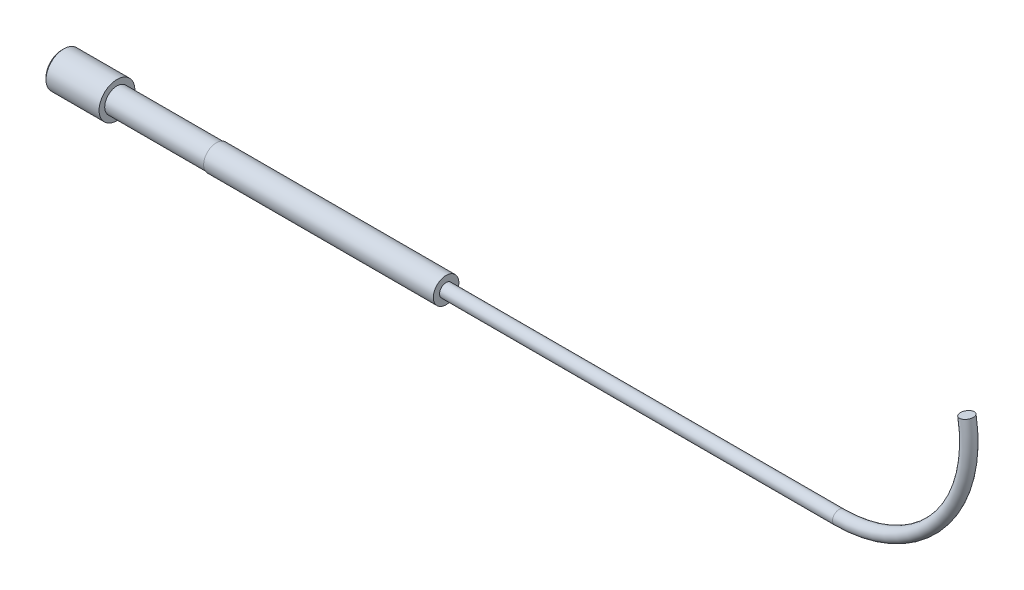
ISO-10303-21;
HEADER;
FILE_DESCRIPTION(('STEP AP214'),'2;1');
FILE_NAME('part.step','',(''),(''),'','','');
FILE_SCHEMA(('AUTOMOTIVE_DESIGN { 1 0 10303 214 1 1 1 1 }'));
ENDSEC;
DATA;
#1=APPLICATION_CONTEXT('core data for automotive mechanical design processes');
#2=APPLICATION_PROTOCOL_DEFINITION('international standard','automotive_design',2000,#1);
#3=PRODUCT_CONTEXT('',#1,'mechanical');
#4=PRODUCT('Part','Part','',(#3));
#5=PRODUCT_RELATED_PRODUCT_CATEGORY('part','',(#4));
#6=PRODUCT_DEFINITION_FORMATION('','',#4);
#7=PRODUCT_DEFINITION_CONTEXT('part definition',#1,'design');
#8=PRODUCT_DEFINITION('design','',#6,#7);
#9=PRODUCT_DEFINITION_SHAPE('','',#8);
#10=(LENGTH_UNIT() NAMED_UNIT(*) SI_UNIT(.MILLI.,.METRE.));
#11=(NAMED_UNIT(*) PLANE_ANGLE_UNIT() SI_UNIT($,.RADIAN.));
#12=(NAMED_UNIT(*) SI_UNIT($,.STERADIAN.) SOLID_ANGLE_UNIT());
#13=UNCERTAINTY_MEASURE_WITH_UNIT(LENGTH_MEASURE(1.E-05),#10,'distance_accuracy_value','');
#14=(GEOMETRIC_REPRESENTATION_CONTEXT(3) GLOBAL_UNCERTAINTY_ASSIGNED_CONTEXT((#13)) GLOBAL_UNIT_ASSIGNED_CONTEXT((#10,
#11,#12)) REPRESENTATION_CONTEXT('',''));
#15=CARTESIAN_POINT('',(0.,0.,0.));
#16=DIRECTION('',(0.,0.,1.));
#17=DIRECTION('',(1.,0.,0.));
#18=AXIS2_PLACEMENT_3D('',#15,#16,#17);
#19=CARTESIAN_POINT('',(4.7625,1.651,0.));
#20=DIRECTION('',(1.,0.,0.));
#21=DIRECTION('',(0.,0.,-1.));
#22=AXIS2_PLACEMENT_3D('',#19,#20,#21);
#23=PLANE('',#22);
#24=CARTESIAN_POINT('',(4.7625,0.,0.));
#25=DIRECTION('',(-1.,0.,0.));
#26=DIRECTION('',(0.,0.,1.));
#27=AXIS2_PLACEMENT_3D('',#24,#25,#26);
#28=CIRCLE('',#27,0.254);
#29=CARTESIAN_POINT('',(4.7625,0.,0.254));
#30=VERTEX_POINT('',#29);
#31=EDGE_CURVE('E79',#30,#30,#28,.T.);
#32=ORIENTED_EDGE('',*,*,#31,.F.);
#33=EDGE_LOOP('',(#32));
#34=FACE_BOUND('',#33,.T.);
#35=CARTESIAN_POINT('',(4.7625,0.,0.));
#36=DIRECTION('',(-1.,0.,0.));
#37=DIRECTION('',(0.,0.,1.));
#38=AXIS2_PLACEMENT_3D('',#35,#36,#37);
#39=CIRCLE('',#38,1.651);
#40=CARTESIAN_POINT('',(4.7625,0.,1.651));
#41=VERTEX_POINT('',#40);
#42=EDGE_CURVE('E50',#41,#41,#39,.T.);
#43=ORIENTED_EDGE('',*,*,#42,.T.);
#44=EDGE_LOOP('',(#43));
#45=FACE_BOUND('',#44,.T.);
#46=ADVANCED_FACE('F35',(#34,#45),#23,.F.);
#47=CARTESIAN_POINT('',(0.,0.,0.));
#48=DIRECTION('',(-1.,0.,0.));
#49=DIRECTION('',(0.,0.,1.));
#50=AXIS2_PLACEMENT_3D('',#47,#48,#49);
#51=CYLINDRICAL_SURFACE('',#50,1.651);
#52=ORIENTED_EDGE('',*,*,#42,.F.);
#53=EDGE_LOOP('',(#52));
#54=FACE_BOUND('',#53,.T.);
#55=CARTESIAN_POINT('',(0.,0.,0.));
#56=DIRECTION('',(-1.,0.,0.));
#57=DIRECTION('',(0.,0.,1.));
#58=AXIS2_PLACEMENT_3D('',#55,#56,#57);
#59=CIRCLE('',#58,1.651);
#60=CARTESIAN_POINT('',(0.,0.,1.651));
#61=VERTEX_POINT('',#60);
#62=EDGE_CURVE('E55',#61,#61,#59,.T.);
#63=ORIENTED_EDGE('',*,*,#62,.T.);
#64=EDGE_LOOP('',(#63));
#65=FACE_BOUND('',#64,.T.);
#66=ADVANCED_FACE('F118',(#54,#65),#51,.F.);
#67=CARTESIAN_POINT('',(0.,2.2225,0.));
#68=DIRECTION('',(1.,0.,0.));
#69=DIRECTION('',(0.,0.,-1.));
#70=AXIS2_PLACEMENT_3D('',#67,#68,#69);
#71=PLANE('',#70);
#72=CARTESIAN_POINT('',(0.,0.,0.));
#73=DIRECTION('',(1.,0.,0.));
#74=DIRECTION('',(0.,0.,-1.));
#75=AXIS2_PLACEMENT_3D('',#72,#73,#74);
#76=CIRCLE('',#75,1.96850000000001);
#77=CARTESIAN_POINT('',(0.,0.,-1.96850000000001));
#78=VERTEX_POINT('',#77);
#79=EDGE_CURVE('E42',#78,#78,#76,.F.);
#80=ORIENTED_EDGE('',*,*,#79,.T.);
#81=EDGE_LOOP('',(#80));
#82=FACE_BOUND('',#81,.T.);
#83=ORIENTED_EDGE('',*,*,#62,.F.);
#84=EDGE_LOOP('',(#83));
#85=FACE_BOUND('',#84,.T.);
#86=ADVANCED_FACE('F123',(#82,#85),#71,.F.);
#87=CARTESIAN_POINT('',(0.,0.,0.));
#88=DIRECTION('',(-1.,0.,0.));
#89=DIRECTION('',(0.,0.,1.));
#90=AXIS2_PLACEMENT_3D('',#87,#88,#89);
#91=CYLINDRICAL_SURFACE('',#90,2.2225);
#92=CARTESIAN_POINT('',(0.253999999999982,0.,0.));
#93=DIRECTION('',(1.,0.,0.));
#94=DIRECTION('',(0.,0.,-1.));
#95=AXIS2_PLACEMENT_3D('',#92,#93,#94);
#96=CIRCLE('',#95,2.2225);
#97=CARTESIAN_POINT('',(0.253999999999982,0.,-2.2225));
#98=VERTEX_POINT('',#97);
#99=EDGE_CURVE('E10',#98,#98,#96,.T.);
#100=ORIENTED_EDGE('',*,*,#99,.T.);
#101=EDGE_LOOP('',(#100));
#102=FACE_BOUND('',#101,.T.);
#103=CARTESIAN_POINT('',(6.858,0.,0.));
#104=DIRECTION('',(-1.,0.,0.));
#105=DIRECTION('',(0.,0.,1.));
#106=AXIS2_PLACEMENT_3D('',#103,#104,#105);
#107=CIRCLE('',#106,2.2225);
#108=CARTESIAN_POINT('',(6.858,0.,2.2225));
#109=VERTEX_POINT('',#108);
#110=EDGE_CURVE('E58',#109,#109,#107,.T.);
#111=ORIENTED_EDGE('',*,*,#110,.T.);
#112=EDGE_LOOP('',(#111));
#113=FACE_BOUND('',#112,.T.);
#114=ADVANCED_FACE('F131',(#102,#113),#91,.T.);
#115=CARTESIAN_POINT('',(6.858,2.2225,0.));
#116=DIRECTION('',(-1.,0.,0.));
#117=DIRECTION('',(0.,0.,1.));
#118=AXIS2_PLACEMENT_3D('',#115,#116,#117);
#119=PLANE('',#118);
#120=ORIENTED_EDGE('',*,*,#110,.F.);
#121=EDGE_LOOP('',(#120));
#122=FACE_BOUND('',#121,.T.);
#123=CARTESIAN_POINT('',(6.858,0.,0.));
#124=DIRECTION('',(-1.,0.,0.));
#125=DIRECTION('',(0.,0.,1.));
#126=AXIS2_PLACEMENT_3D('',#123,#124,#125);
#127=CIRCLE('',#126,1.524);
#128=CARTESIAN_POINT('',(6.858,0.,1.524));
#129=VERTEX_POINT('',#128);
#130=EDGE_CURVE('E62',#129,#129,#127,.T.);
#131=ORIENTED_EDGE('',*,*,#130,.T.);
#132=EDGE_LOOP('',(#131));
#133=FACE_BOUND('',#132,.T.);
#134=ADVANCED_FACE('F134',(#122,#133),#119,.F.);
#135=CARTESIAN_POINT('',(0.,0.,0.));
#136=DIRECTION('',(-1.,0.,0.));
#137=DIRECTION('',(0.,0.,1.));
#138=AXIS2_PLACEMENT_3D('',#135,#136,#137);
#139=CYLINDRICAL_SURFACE('',#138,1.524);
#140=ORIENTED_EDGE('',*,*,#130,.F.);
#141=EDGE_LOOP('',(#140));
#142=FACE_BOUND('',#141,.T.);
#143=CARTESIAN_POINT('',(19.2278,0.,0.));
#144=DIRECTION('',(-1.,0.,0.));
#145=DIRECTION('',(0.,0.,1.));
#146=AXIS2_PLACEMENT_3D('',#143,#144,#145);
#147=CIRCLE('',#146,1.524);
#148=CARTESIAN_POINT('',(19.2278,0.,1.524));
#149=VERTEX_POINT('',#148);
#150=EDGE_CURVE('E66',#149,#149,#147,.T.);
#151=ORIENTED_EDGE('',*,*,#150,.T.);
#152=EDGE_LOOP('',(#151));
#153=FACE_BOUND('',#152,.T.);
#154=ADVANCED_FACE('F113',(#142,#153),#139,.T.);
#155=CARTESIAN_POINT('',(19.2278,1.524,0.));
#156=DIRECTION('',(1.,0.,0.));
#157=DIRECTION('',(0.,0.,-1.));
#158=AXIS2_PLACEMENT_3D('',#155,#156,#157);
#159=PLANE('',#158);
#160=ORIENTED_EDGE('',*,*,#150,.F.);
#161=EDGE_LOOP('',(#160));
#162=FACE_BOUND('',#161,.T.);
#163=CARTESIAN_POINT('',(19.2278,0.,0.));
#164=DIRECTION('',(-1.,0.,0.));
#165=DIRECTION('',(0.,0.,1.));
#166=AXIS2_PLACEMENT_3D('',#163,#164,#165);
#167=CIRCLE('',#166,1.5875);
#168=CARTESIAN_POINT('',(19.2278,0.,1.5875));
#169=VERTEX_POINT('',#168);
#170=EDGE_CURVE('E69',#169,#169,#167,.T.);
#171=ORIENTED_EDGE('',*,*,#170,.T.);
#172=EDGE_LOOP('',(#171));
#173=FACE_BOUND('',#172,.T.);
#174=ADVANCED_FACE('F107',(#162,#173),#159,.F.);
#175=CARTESIAN_POINT('',(0.,0.,0.));
#176=DIRECTION('',(-1.,0.,0.));
#177=DIRECTION('',(0.,0.,1.));
#178=AXIS2_PLACEMENT_3D('',#175,#176,#177);
#179=CYLINDRICAL_SURFACE('',#178,1.5875);
#180=ORIENTED_EDGE('',*,*,#170,.F.);
#181=EDGE_LOOP('',(#180));
#182=FACE_BOUND('',#181,.T.);
#183=CARTESIAN_POINT('',(47.8028,0.,0.));
#184=DIRECTION('',(-1.,0.,0.));
#185=DIRECTION('',(0.,0.,1.));
#186=AXIS2_PLACEMENT_3D('',#183,#184,#185);
#187=CIRCLE('',#186,1.5875);
#188=CARTESIAN_POINT('',(47.8028,0.,1.5875));
#189=VERTEX_POINT('',#188);
#190=EDGE_CURVE('E72',#189,#189,#187,.T.);
#191=ORIENTED_EDGE('',*,*,#190,.T.);
#192=EDGE_LOOP('',(#191));
#193=FACE_BOUND('',#192,.T.);
#194=ADVANCED_FACE('F102',(#182,#193),#179,.T.);
#195=CARTESIAN_POINT('',(47.8028,1.5875,0.));
#196=DIRECTION('',(-1.,0.,0.));
#197=DIRECTION('',(0.,0.,1.));
#198=AXIS2_PLACEMENT_3D('',#195,#196,#197);
#199=PLANE('',#198);
#200=CARTESIAN_POINT('',(47.8028,0.,0.));
#201=DIRECTION('',(1.,0.,0.));
#202=DIRECTION('',(0.,0.,-1.));
#203=AXIS2_PLACEMENT_3D('',#200,#201,#202);
#204=CIRCLE('',#203,0.8128);
#205=CARTESIAN_POINT('',(47.8028,0.,-0.8128));
#206=VERTEX_POINT('',#205);
#207=EDGE_CURVE('E46',#206,#206,#204,.T.);
#208=ORIENTED_EDGE('',*,*,#207,.F.);
#209=EDGE_LOOP('',(#208));
#210=FACE_BOUND('',#209,.T.);
#211=ORIENTED_EDGE('',*,*,#190,.F.);
#212=EDGE_LOOP('',(#211));
#213=FACE_BOUND('',#212,.T.);
#214=ADVANCED_FACE('F98',(#210,#213),#199,.F.);
#215=CARTESIAN_POINT('',(1.27,0.254,0.));
#216=DIRECTION('',(1.,0.,0.));
#217=DIRECTION('',(0.,0.,-1.));
#218=AXIS2_PLACEMENT_3D('',#215,#216,#217);
#219=PLANE('',#218);
#220=CARTESIAN_POINT('',(1.27,0.,0.));
#221=DIRECTION('',(-1.,0.,0.));
#222=DIRECTION('',(0.,0.,1.));
#223=AXIS2_PLACEMENT_3D('',#220,#221,#222);
#224=CIRCLE('',#223,0.254);
#225=CARTESIAN_POINT('',(1.27,0.,0.254));
#226=VERTEX_POINT('',#225);
#227=EDGE_CURVE('E76',#226,#226,#224,.T.);
#228=ORIENTED_EDGE('',*,*,#227,.T.);
#229=EDGE_LOOP('',(#228));
#230=FACE_BOUND('',#229,.T.);
#231=ADVANCED_FACE('F101',(#230),#219,.F.);
#232=CARTESIAN_POINT('',(0.,0.,0.));
#233=DIRECTION('',(-1.,0.,0.));
#234=DIRECTION('',(0.,0.,1.));
#235=AXIS2_PLACEMENT_3D('',#232,#233,#234);
#236=CYLINDRICAL_SURFACE('',#235,0.254);
#237=ORIENTED_EDGE('',*,*,#227,.F.);
#238=EDGE_LOOP('',(#237));
#239=FACE_BOUND('',#238,.T.);
#240=ORIENTED_EDGE('',*,*,#31,.T.);
#241=EDGE_LOOP('',(#240));
#242=FACE_BOUND('',#241,.T.);
#243=ADVANCED_FACE('F171',(#239,#242),#236,.T.);
#244=CARTESIAN_POINT('',(112.583283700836,18.9360073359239,0.));
#245=DIRECTION('',(-0.172978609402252,0.984925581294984,0.));
#246=DIRECTION('',(0.,0.,-1.));
#247=AXIS2_PLACEMENT_3D('',#244,#245,#246);
#248=PLANE('',#247);
#249=CARTESIAN_POINT('',(112.583283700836,18.9360073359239,0.));
#250=DIRECTION('',(-0.172978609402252,0.984925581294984,0.));
#251=DIRECTION('',(0.,0.,-1.));
#252=AXIS2_PLACEMENT_3D('',#249,#250,#251);
#253=CIRCLE('',#252,0.8128);
#254=CARTESIAN_POINT('',(113.383831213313,19.0766043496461,0.));
#255=VERTEX_POINT('',#254);
#256=EDGE_CURVE('E82',#255,#255,#253,.T.);
#257=ORIENTED_EDGE('',*,*,#256,.T.);
#258=EDGE_LOOP('',(#257));
#259=FACE_BOUND('',#258,.T.);
#260=ADVANCED_FACE('F94',(#259),#248,.T.);
#261=CARTESIAN_POINT('',(47.8028,0.,0.));
#262=DIRECTION('',(1.,0.,0.));
#263=DIRECTION('',(0.,0.,-1.));
#264=AXIS2_PLACEMENT_3D('',#261,#262,#263);
#265=CYLINDRICAL_SURFACE('',#264,0.8128);
#266=CARTESIAN_POINT('',(96.683114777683,0.,0.));
#267=DIRECTION('',(1.,0.,0.));
#268=DIRECTION('',(0.,0.,-1.));
#269=AXIS2_PLACEMENT_3D('',#266,#267,#268);
#270=CIRCLE('',#269,0.8128);
#271=CARTESIAN_POINT('',(96.683114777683,-0.812799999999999,0.));
#272=VERTEX_POINT('',#271);
#273=EDGE_CURVE('E85',#272,#272,#270,.T.);
#274=ORIENTED_EDGE('',*,*,#273,.F.);
#275=EDGE_LOOP('',(#274));
#276=FACE_BOUND('',#275,.T.);
#277=ORIENTED_EDGE('',*,*,#207,.T.);
#278=EDGE_LOOP('',(#277));
#279=FACE_BOUND('',#278,.T.);
#280=ADVANCED_FACE('F91',(#276,#279),#265,.T.);
#281=CARTESIAN_POINT('',(96.683114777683,16.1435231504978,0.));
#282=DIRECTION('',(0.,0.,1.));
#283=DIRECTION('',(1.,0.,0.));
#284=AXIS2_PLACEMENT_3D('',#281,#282,#283);
#285=TOROIDAL_SURFACE('',#284,16.1435231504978,0.8128);
#286=CARTESIAN_POINT('',(96.683114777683,16.1435231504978,0.));
#287=DIRECTION('',(0.,0.,1.));
#288=DIRECTION('',(1.,0.,0.));
#289=AXIS2_PLACEMENT_3D('',#286,#287,#288);
#290=CIRCLE('',#289,16.9563231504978);
#291=EDGE_CURVE('',#272,#255,#290,.T.);
#292=ORIENTED_EDGE('',*,*,#273,.T.);
#293=ORIENTED_EDGE('',*,*,#256,.F.);
#294=ORIENTED_EDGE('',*,*,#291,.T.);
#295=ORIENTED_EDGE('',*,*,#291,.F.);
#296=EDGE_LOOP('',(#292,#294,#293,#295));
#297=FACE_BOUND('',#296,.T.);
#298=ADVANCED_FACE('F89',(#297),#285,.T.);
#299=CARTESIAN_POINT('',(0.,0.,0.));
#300=DIRECTION('',(1.,0.,0.));
#301=DIRECTION('',(0.,0.,-1.));
#302=AXIS2_PLACEMENT_3D('',#299,#300,#301);
#303=CONICAL_SURFACE('',#302,1.96850000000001,0.78539816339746);
#304=ORIENTED_EDGE('',*,*,#99,.F.);
#305=EDGE_LOOP('',(#304));
#306=FACE_BOUND('',#305,.T.);
#307=ORIENTED_EDGE('',*,*,#79,.F.);
#308=EDGE_LOOP('',(#307));
#309=FACE_BOUND('',#308,.T.);
#310=ADVANCED_FACE('F37',(#306,#309),#303,.T.);
#311=CLOSED_SHELL('',(#46,#66,#86,#114,#134,#154,#174,#194,#214,#231,#243,#260,#280,#298,#310));
#312=MANIFOLD_SOLID_BREP('B2',#311);
#313=ADVANCED_BREP_SHAPE_REPRESENTATION('',(#18,#312),#14);
#314=SHAPE_DEFINITION_REPRESENTATION(#9,#313);
ENDSEC;
END-ISO-10303-21;
